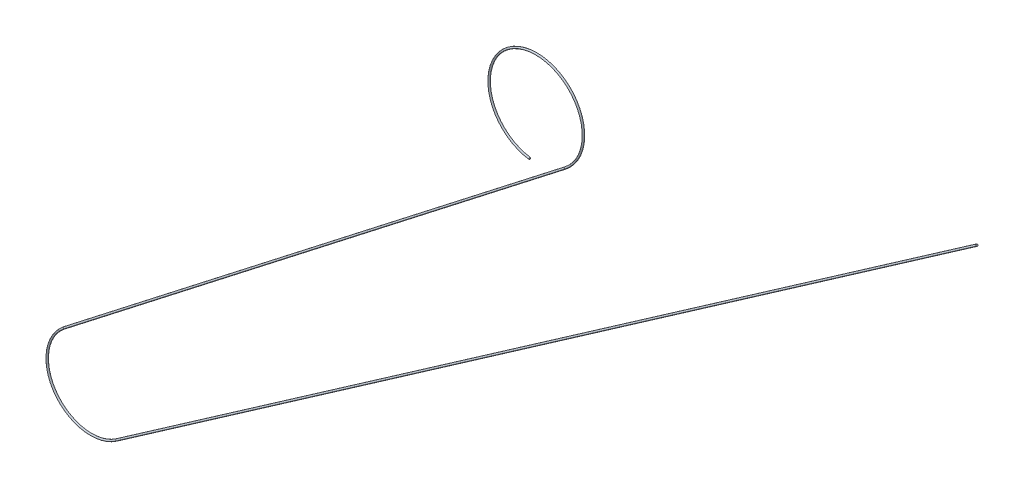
from build123d import *

# Parameters (mm, degrees)
ESQUISSE2_R = 2.5


with BuildPart() as part:
    # Balayage1: sweep along a path in Esquisse1
    with BuildLine(Plane(origin=(1828.716242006, 1046.423867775, 0), x_dir=(-0.5713222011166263, 0.8207258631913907, 0), z_dir=(0, 0, 1))) as balayage1_path:
        Line((185.959056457, 2098.719903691), (185.959056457, 5072.669927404))
        ThreePointArc((185.959056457, 5072.669927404), (307.707707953, 5197.627635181), (435.789916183, 5079.170424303))
        Line((435.789916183, 5079.170424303), (529.339532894, 3282.71097479))
        ThreePointArc((529.339532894, 3282.71097479), (788.766982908, 3244.12065016), (564.763408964, 3380.55456763))
    # Esquisse2 → Balayage1 (sweep)
    with BuildSketch(Plane(origin=(0, 0, 0), x_dir=(0, 0, -1), z_dir=(0.8207258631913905, 0.5713222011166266, 0))):
        Circle(ESQUISSE2_R)
    sweep(path=balayage1_path.line)


solid = part.part
